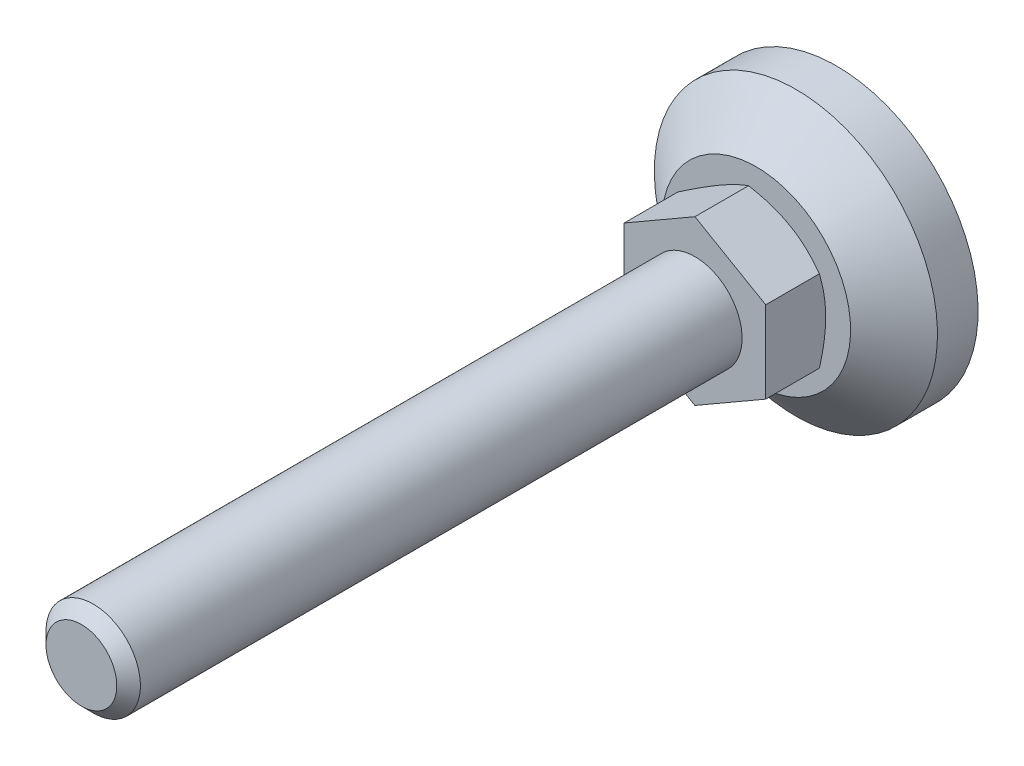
ISO-10303-21;
HEADER;
FILE_DESCRIPTION(('STEP AP214'),'2;1');
FILE_NAME('part.step','',(''),(''),'','','');
FILE_SCHEMA(('AUTOMOTIVE_DESIGN { 1 0 10303 214 1 1 1 1 }'));
ENDSEC;
DATA;
#1=APPLICATION_CONTEXT('core data for automotive mechanical design processes');
#2=APPLICATION_PROTOCOL_DEFINITION('international standard','automotive_design',2000,#1);
#3=PRODUCT_CONTEXT('',#1,'mechanical');
#4=PRODUCT('Part','Part','',(#3));
#5=PRODUCT_RELATED_PRODUCT_CATEGORY('part','',(#4));
#6=PRODUCT_DEFINITION_FORMATION('','',#4);
#7=PRODUCT_DEFINITION_CONTEXT('part definition',#1,'design');
#8=PRODUCT_DEFINITION('design','',#6,#7);
#9=PRODUCT_DEFINITION_SHAPE('','',#8);
#10=(LENGTH_UNIT() NAMED_UNIT(*) SI_UNIT(.MILLI.,.METRE.));
#11=(NAMED_UNIT(*) PLANE_ANGLE_UNIT() SI_UNIT($,.RADIAN.));
#12=(NAMED_UNIT(*) SI_UNIT($,.STERADIAN.) SOLID_ANGLE_UNIT());
#13=UNCERTAINTY_MEASURE_WITH_UNIT(LENGTH_MEASURE(1.E-05),#10,'distance_accuracy_value','');
#14=(GEOMETRIC_REPRESENTATION_CONTEXT(3) GLOBAL_UNCERTAINTY_ASSIGNED_CONTEXT((#13)) GLOBAL_UNIT_ASSIGNED_CONTEXT((#10,
#11,#12)) REPRESENTATION_CONTEXT('',''));
#15=CARTESIAN_POINT('',(0.,0.,0.));
#16=DIRECTION('',(0.,0.,1.));
#17=DIRECTION('',(1.,0.,0.));
#18=AXIS2_PLACEMENT_3D('',#15,#16,#17);
#19=CARTESIAN_POINT('',(0.,0.,30.));
#20=DIRECTION('',(0.,0.,1.));
#21=DIRECTION('',(0.5,-0.86602540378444,0.));
#22=AXIS2_PLACEMENT_3D('',#19,#20,#21);
#23=PLANE('',#22);
#24=DIRECTION('',(0.,1.,0.));
#25=VECTOR('',#24,1.);
#26=CARTESIAN_POINT('',(15.,-8.66025403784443,30.));
#27=LINE('',#26,#25);
#28=CARTESIAN_POINT('',(15.,-8.66025403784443,30.));
#29=VERTEX_POINT('',#28);
#30=CARTESIAN_POINT('',(15.,8.66025403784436,30.));
#31=VERTEX_POINT('',#30);
#32=EDGE_CURVE('E197',#29,#31,#27,.T.);
#33=ORIENTED_EDGE('',*,*,#32,.T.);
#34=DIRECTION('',(-0.866025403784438,0.5,0.));
#35=VECTOR('',#34,1.);
#36=CARTESIAN_POINT('',(15.,8.66025403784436,30.));
#37=LINE('',#36,#35);
#38=CARTESIAN_POINT('',(0.,17.3205080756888,30.));
#39=VERTEX_POINT('',#38);
#40=EDGE_CURVE('E320',#31,#39,#37,.T.);
#41=ORIENTED_EDGE('',*,*,#40,.T.);
#42=DIRECTION('',(-0.86602540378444,-0.5,0.));
#43=VECTOR('',#42,1.);
#44=CARTESIAN_POINT('',(0.,17.3205080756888,30.));
#45=LINE('',#44,#43);
#46=CARTESIAN_POINT('',(-15.,8.66025403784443,30.));
#47=VERTEX_POINT('',#46);
#48=EDGE_CURVE('E319',#39,#47,#45,.T.);
#49=ORIENTED_EDGE('',*,*,#48,.T.);
#50=DIRECTION('',(0.,-1.,0.));
#51=VECTOR('',#50,1.);
#52=CARTESIAN_POINT('',(-15.,8.66025403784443,30.));
#53=LINE('',#52,#51);
#54=CARTESIAN_POINT('',(-15.,-8.66025403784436,30.));
#55=VERTEX_POINT('',#54);
#56=EDGE_CURVE('E324',#47,#55,#53,.T.);
#57=ORIENTED_EDGE('',*,*,#56,.T.);
#58=DIRECTION('',(0.866025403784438,-0.5,0.));
#59=VECTOR('',#58,1.);
#60=CARTESIAN_POINT('',(-15.,-8.66025403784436,30.));
#61=LINE('',#60,#59);
#62=CARTESIAN_POINT('',(0.,-17.3205080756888,30.));
#63=VERTEX_POINT('',#62);
#64=EDGE_CURVE('E326',#55,#63,#61,.T.);
#65=ORIENTED_EDGE('',*,*,#64,.T.);
#66=DIRECTION('',(0.86602540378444,0.5,0.));
#67=VECTOR('',#66,1.);
#68=CARTESIAN_POINT('',(0.,-17.3205080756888,30.));
#69=LINE('',#68,#67);
#70=EDGE_CURVE('E37',#63,#29,#69,.T.);
#71=ORIENTED_EDGE('',*,*,#70,.T.);
#72=EDGE_LOOP('',(#33,#41,#49,#57,#65,#71));
#73=FACE_BOUND('',#72,.T.);
#74=CARTESIAN_POINT('',(0.,0.,30.));
#75=DIRECTION('',(0.,0.,1.));
#76=DIRECTION('',(0.5,-0.86602540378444,0.));
#77=AXIS2_PLACEMENT_3D('',#74,#75,#76);
#78=CIRCLE('',#77,10.);
#79=CARTESIAN_POINT('',(5.,-8.6602540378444,30.));
#80=VERTEX_POINT('',#79);
#81=EDGE_CURVE('E201',#80,#80,#78,.T.);
#82=ORIENTED_EDGE('',*,*,#81,.F.);
#83=EDGE_LOOP('',(#82));
#84=FACE_BOUND('',#83,.T.);
#85=ADVANCED_FACE('F14',(#73,#84),#23,.T.);
#86=CARTESIAN_POINT('',(-9.9946349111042,17.3112154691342,17.));
#87=DIRECTION('',(0.,0.,1.));
#88=DIRECTION('',(0.5,-0.86602540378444,0.));
#89=AXIS2_PLACEMENT_3D('',#86,#87,#88);
#90=PLANE('',#89);
#91=CARTESIAN_POINT('',(0.,0.,17.));
#92=DIRECTION('',(0.,0.,-1.));
#93=DIRECTION('',(-0.5,0.86602540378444,0.));
#94=AXIS2_PLACEMENT_3D('',#91,#92,#93);
#95=CIRCLE('',#94,19.9892698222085);
#96=CARTESIAN_POINT('',(-9.99463491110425,17.3112154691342,17.));
#97=VERTEX_POINT('',#96);
#98=EDGE_CURVE('E102',#97,#97,#95,.T.);
#99=ORIENTED_EDGE('',*,*,#98,.F.);
#100=EDGE_LOOP('',(#99));
#101=FACE_BOUND('',#100,.T.);
#102=CARTESIAN_POINT('',(0.,0.,17.));
#103=DIRECTION('',(0.,0.,-1.));
#104=DIRECTION('',(-0.5,0.86602540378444,0.));
#105=AXIS2_PLACEMENT_3D('',#102,#103,#104);
#106=CIRCLE('',#105,14.5);
#107=CARTESIAN_POINT('',(-7.25,12.5573683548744,17.));
#108=VERTEX_POINT('',#107);
#109=EDGE_CURVE('E84',#108,#108,#106,.T.);
#110=ORIENTED_EDGE('',*,*,#109,.T.);
#111=EDGE_LOOP('',(#110));
#112=FACE_BOUND('',#111,.T.);
#113=ADVANCED_FACE('F174',(#101,#112),#90,.T.);
#114=CARTESIAN_POINT('',(0.,0.,0.));
#115=DIRECTION('',(0.,0.,-1.));
#116=DIRECTION('',(-0.5,0.86602540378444,0.));
#117=AXIS2_PLACEMENT_3D('',#114,#115,#116);
#118=PLANE('',#117);
#119=CARTESIAN_POINT('',(0.,0.,0.));
#120=DIRECTION('',(0.,0.,-1.));
#121=DIRECTION('',(-0.5,0.86602540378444,0.));
#122=AXIS2_PLACEMENT_3D('',#119,#120,#121);
#123=CIRCLE('',#122,30.);
#124=CARTESIAN_POINT('',(-15.,25.9807621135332,0.));
#125=VERTEX_POINT('',#124);
#126=EDGE_CURVE('E73',#125,#125,#123,.T.);
#127=ORIENTED_EDGE('',*,*,#126,.T.);
#128=EDGE_LOOP('',(#127));
#129=FACE_BOUND('',#128,.T.);
#130=ADVANCED_FACE('F177',(#129),#118,.T.);
#131=CARTESIAN_POINT('',(0.,0.,-75.4972525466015));
#132=DIRECTION('',(0.,0.,-1.));
#133=DIRECTION('',(-0.5,0.86602540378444,0.));
#134=AXIS2_PLACEMENT_3D('',#131,#132,#133);
#135=CYLINDRICAL_SURFACE('',#134,30.);
#136=CARTESIAN_POINT('',(0.,0.,8.6));
#137=DIRECTION('',(0.,0.,-1.));
#138=DIRECTION('',(-0.5,0.86602540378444,0.));
#139=AXIS2_PLACEMENT_3D('',#136,#137,#138);
#140=CIRCLE('',#139,30.);
#141=CARTESIAN_POINT('',(-15.,25.9807621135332,8.6));
#142=VERTEX_POINT('',#141);
#143=EDGE_CURVE('E105',#142,#142,#140,.T.);
#144=ORIENTED_EDGE('',*,*,#143,.T.);
#145=EDGE_LOOP('',(#144));
#146=FACE_BOUND('',#145,.T.);
#147=ORIENTED_EDGE('',*,*,#126,.F.);
#148=EDGE_LOOP('',(#147));
#149=FACE_BOUND('',#148,.T.);
#150=ADVANCED_FACE('F181',(#146,#149),#135,.T.);
#151=CARTESIAN_POINT('',(0.,0.,8.6));
#152=DIRECTION('',(0.,0.,-1.));
#153=DIRECTION('',(-0.5,0.86602540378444,0.));
#154=AXIS2_PLACEMENT_3D('',#151,#152,#153);
#155=CONICAL_SURFACE('',#154,30.,0.872664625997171);
#156=ORIENTED_EDGE('',*,*,#98,.T.);
#157=EDGE_LOOP('',(#156));
#158=FACE_BOUND('',#157,.T.);
#159=ORIENTED_EDGE('',*,*,#143,.F.);
#160=EDGE_LOOP('',(#159));
#161=FACE_BOUND('',#160,.T.);
#162=ADVANCED_FACE('F121',(#158,#161),#155,.T.);
#163=CARTESIAN_POINT('',(0.,0.,22.6717337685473));
#164=DIRECTION('',(0.,0.,1.));
#165=DIRECTION('',(0.5,-0.86602540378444,0.));
#166=AXIS2_PLACEMENT_3D('',#163,#164,#165);
#167=CONICAL_SURFACE('',#166,24.3237310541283,1.0471975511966);
#168=ORIENTED_EDGE('',*,*,#109,.F.);
#169=EDGE_LOOP('',(#168));
#170=FACE_BOUND('',#169,.T.);
#171=CARTESIAN_POINT('',(-12.8456594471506,-24.7369530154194,24.7211504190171));
#172=CARTESIAN_POINT('',(-12.5611280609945,-24.5726787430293,24.5612751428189));
#173=CARTESIAN_POINT('',(-12.2762681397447,-24.4082147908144,24.4021798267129));
#174=CARTESIAN_POINT('',(-11.7058227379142,-24.0788679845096,24.0857253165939));
#175=CARTESIAN_POINT('',(-11.4202372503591,-23.913985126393,23.9283661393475));
#176=CARTESIAN_POINT('',(-10.5622163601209,-23.4186065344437,23.4591171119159));
#177=CARTESIAN_POINT('',(-9.98859766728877,-23.0874276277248,23.1501014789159));
#178=CARTESIAN_POINT('',(-8.83456075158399,-22.4211441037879,22.5399454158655));
#179=CARTESIAN_POINT('',(-8.25412262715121,-22.0860279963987,22.2388550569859));
#180=CARTESIAN_POINT('',(-7.08869976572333,-21.4131707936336,21.6486868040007));
#181=CARTESIAN_POINT('',(-6.50371523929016,-21.0754298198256,21.3596083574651));
#182=CARTESIAN_POINT('',(-5.30863673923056,-20.3854509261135,20.7872320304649));
#183=CARTESIAN_POINT('',(-4.69835665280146,-20.0331055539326,20.5044496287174));
#184=CARTESIAN_POINT('',(-3.47072651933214,-19.3243329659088,19.9597325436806));
#185=CARTESIAN_POINT('',(-2.85337569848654,-18.9679053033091,19.6978001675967));
#186=CARTESIAN_POINT('',(-1.61173392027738,-18.251043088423,19.2014950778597));
#187=CARTESIAN_POINT('',(-0.987459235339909,-17.8906179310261,18.9670685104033));
#188=CARTESIAN_POINT('',(0.270101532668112,-17.1645648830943,18.533130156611));
#189=CARTESIAN_POINT('',(0.903384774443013,-16.7989386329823,18.3336076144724));
#190=CARTESIAN_POINT('',(1.85843143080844,-16.2475421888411,18.0681549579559));
#191=CARTESIAN_POINT('',(2.17672728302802,-16.0637739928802,17.9854955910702));
#192=CARTESIAN_POINT('',(2.8155301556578,-15.6949609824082,17.8324159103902));
#193=CARTESIAN_POINT('',(3.13603713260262,-15.509916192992,17.761995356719));
#194=CARTESIAN_POINT('',(3.77905622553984,-15.1386689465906,17.6346216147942));
#195=CARTESIAN_POINT('',(4.1015683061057,-14.952466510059,17.5776681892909));
#196=CARTESIAN_POINT('',(4.7482706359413,-14.5790927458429,17.4783560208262));
#197=CARTESIAN_POINT('',(5.07246081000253,-14.39192146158,17.4359966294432));
#198=CARTESIAN_POINT('',(5.7177482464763,-14.0193645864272,17.3672579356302));
#199=CARTESIAN_POINT('',(6.03882895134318,-13.8339885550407,17.3406726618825));
#200=CARTESIAN_POINT('',(6.68167638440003,-13.4628404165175,17.3032157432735));
#201=CARTESIAN_POINT('',(7.0034431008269,-13.2770683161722,17.2923438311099));
#202=CARTESIAN_POINT('',(7.64708696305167,-12.9054603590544,17.2865732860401));
#203=CARTESIAN_POINT('',(7.96896410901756,-12.719624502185,17.291674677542));
#204=CARTESIAN_POINT('',(8.6122410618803,-12.3482283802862,17.31772364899));
#205=CARTESIAN_POINT('',(8.93364084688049,-12.1626681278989,17.3386719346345));
#206=CARTESIAN_POINT('',(9.70006843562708,-11.7201709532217,17.4070708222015));
#207=CARTESIAN_POINT('',(10.1446275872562,-11.4635046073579,17.4616548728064));
#208=CARTESIAN_POINT('',(11.0305797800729,-10.9519998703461,17.598223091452));
#209=CARTESIAN_POINT('',(11.4719724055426,-10.6971617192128,17.6802107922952));
#210=CARTESIAN_POINT('',(12.3511241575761,-10.1895832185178,17.8686701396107));
#211=CARTESIAN_POINT('',(12.7888803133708,-9.93684458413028,17.9751600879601));
#212=CARTESIAN_POINT('',(13.6600677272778,-9.43386429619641,18.2093621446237));
#213=CARTESIAN_POINT('',(14.093499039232,-9.18362261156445,18.3370739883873));
#214=CARTESIAN_POINT('',(14.9657613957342,-8.68002170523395,18.6136784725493));
#215=CARTESIAN_POINT('',(15.4044935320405,-8.42671958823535,18.7629840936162));
#216=CARTESIAN_POINT('',(16.2776387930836,-7.92260893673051,19.0774927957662));
#217=CARTESIAN_POINT('',(16.7120518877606,-7.67180041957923,19.2426959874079));
#218=CARTESIAN_POINT('',(17.5767675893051,-7.17255657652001,19.5863356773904));
#219=CARTESIAN_POINT('',(18.0070714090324,-6.92412055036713,19.7647681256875));
#220=CARTESIAN_POINT('',(18.8640855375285,-6.42932321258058,20.1327209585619));
#221=CARTESIAN_POINT('',(19.2907959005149,-6.18296186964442,20.3222411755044));
#222=CARTESIAN_POINT('',(20.3428317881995,-5.57556866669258,20.8026992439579));
#223=CARTESIAN_POINT('',(20.9662920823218,-5.21561369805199,21.0990762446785));
#224=CARTESIAN_POINT('',(22.2075096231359,-4.49899641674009,21.7073961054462));
#225=CARTESIAN_POINT('',(22.8252664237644,-4.14233436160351,22.0193401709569));
#226=CARTESIAN_POINT('',(24.0562171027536,-3.43164465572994,22.6554928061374));
#227=CARTESIAN_POINT('',(24.6694096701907,-3.07761776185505,22.9797047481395));
#228=CARTESIAN_POINT('',(25.8918722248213,-2.37182867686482,23.6377669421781));
#229=CARTESIAN_POINT('',(26.5011423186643,-2.02006642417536,23.9716169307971));
#230=CARTESIAN_POINT('',(27.717227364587,-1.31795939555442,24.6474851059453));
#231=CARTESIAN_POINT('',(28.3240381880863,-0.967617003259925,24.9895131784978));
#232=CARTESIAN_POINT('',(29.5349682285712,-0.268486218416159,25.6798644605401));
#233=CARTESIAN_POINT('',(30.1390874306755,0.0803021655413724,26.0281877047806));
#234=CARTESIAN_POINT('',(31.3449758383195,0.776522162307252,26.7299417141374));
#235=CARTESIAN_POINT('',(31.9467453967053,1.12395397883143,27.0833716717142));
#236=CARTESIAN_POINT('',(33.1483798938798,1.81771797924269,27.7945141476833));
#237=CARTESIAN_POINT('',(33.7482448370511,2.16405016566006,28.1522266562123));
#238=CARTESIAN_POINT('',(35.4362393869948,3.13861427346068,29.1651922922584));
#239=CARTESIAN_POINT('',(36.5225182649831,3.76577767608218,29.8245570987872));
#240=CARTESIAN_POINT('',(38.6911220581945,5.01782165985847,31.1520110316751));
#241=CARTESIAN_POINT('',(39.7734467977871,5.64270213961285,31.8201005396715));
#242=CARTESIAN_POINT('',(41.9319563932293,6.88891823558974,33.1609996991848));
#243=CARTESIAN_POINT('',(43.0081499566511,7.51025887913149,33.8337906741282));
#244=CARTESIAN_POINT('',(44.620597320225,8.441205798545,34.8467910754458));
#245=CARTESIAN_POINT('',(45.1577559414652,8.75133447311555,35.1850829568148));
#246=CARTESIAN_POINT('',(46.2315316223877,9.37127915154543,35.8628086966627));
#247=CARTESIAN_POINT('',(46.7681486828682,9.68109515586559,36.2022425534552));
#248=CARTESIAN_POINT('',(47.3045265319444,9.99077305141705,36.5421798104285));
#249=B_SPLINE_CURVE_WITH_KNOTS('',3,(#171,#172,#173,#174,#175,#176,#177,#178,#179,#180,#181,
#182,#183,#184,#185,#186,#187,#188,#189,#190,#191,#192,#193,#194,#195,#196,#197,#198,#199,#200,
#201,#202,#203,#204,#205,#206,#207,#208,#209,#210,#211,#212,#213,#214,#215,#216,#217,#218,#219,
#220,#221,#222,#223,#224,#225,#226,#227,#228,#229,#230,#231,#232,#233,#234,#235,#236,#237,#238,
#239,#240,#241,#242,#243,#244,#245,#246,#247,#248),.UNSPECIFIED.,.F.,.F.,(4,2,2,2,2,2,2,2,2,2,2,
2,2,2,2,2,2,2,2,2,2,2,2,2,2,2,2,2,2,2,2,2,2,2,2,2,2,2,4),(0.,1.09614509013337,2.19230075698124,
4.38492481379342,6.5891013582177,8.79317641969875,11.0708608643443,13.3487970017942,
15.622195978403,17.894893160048,19.0248728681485,20.1548304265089,21.2847680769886,
22.4146555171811,23.5294447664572,24.6442150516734,25.7589870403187,26.8738086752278,
28.4216372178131,29.9696653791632,31.5188536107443,33.0680225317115,34.6521549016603,
36.236298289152,37.8199586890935,39.4035951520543,41.7389293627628,44.0744446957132,
46.4106067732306,48.7467050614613,51.0857864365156,53.4248807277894,55.7636090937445,
58.1023320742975,62.3535003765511,66.6048552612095,70.8441948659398,72.9637328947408,
75.083267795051),.UNSPECIFIED.);
#250=CARTESIAN_POINT('',(0.,-17.3205080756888,18.6284210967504));
#251=VERTEX_POINT('',#250);
#252=CARTESIAN_POINT('',(15.,-8.66025403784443,18.6284210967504));
#253=VERTEX_POINT('',#252);
#254=EDGE_CURVE('E65',#251,#253,#249,.T.);
#255=ORIENTED_EDGE('',*,*,#254,.F.);
#256=CARTESIAN_POINT('',(-15.0002,-8.66013856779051,18.6284877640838));
#257=CARTESIAN_POINT('',(-14.6705058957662,-8.85048754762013,18.5185969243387));
#258=CARTESIAN_POINT('',(-14.3395258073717,-9.0415789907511,18.4136927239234));
#259=CARTESIAN_POINT('',(-13.674911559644,-9.42529420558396,18.2152437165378));
#260=CARTESIAN_POINT('',(-13.3412765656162,-9.61791845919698,18.1217026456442));
#261=CARTESIAN_POINT('',(-12.6707077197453,-10.0050715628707,17.9472372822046));
#262=CARTESIAN_POINT('',(-12.333767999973,-10.1996038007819,17.8663428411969));
#263=CARTESIAN_POINT('',(-11.6575472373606,-10.5900200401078,17.7189077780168));
#264=CARTESIAN_POINT('',(-11.3182663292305,-10.7859039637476,17.6523663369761));
#265=CARTESIAN_POINT('',(-10.6460568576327,-11.1740042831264,17.5364675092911));
#266=CARTESIAN_POINT('',(-10.3131781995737,-11.3661918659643,17.4867265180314));
#267=CARTESIAN_POINT('',(-9.64589556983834,-11.7514476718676,17.4033218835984));
#268=CARTESIAN_POINT('',(-9.31149156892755,-11.9445159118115,17.3696585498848));
#269=CARTESIAN_POINT('',(-8.64212181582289,-12.3309767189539,17.3192592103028));
#270=CARTESIAN_POINT('',(-8.30715720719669,-12.5243686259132,17.3025030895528));
#271=CARTESIAN_POINT('',(-7.63691878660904,-12.9113309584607,17.2862785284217));
#272=CARTESIAN_POINT('',(-7.30164498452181,-13.104901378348,17.2868095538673));
#273=CARTESIAN_POINT('',(-6.67485311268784,-13.4667798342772,17.303951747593));
#274=CARTESIAN_POINT('',(-6.38329037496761,-13.6351136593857,17.3184719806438));
#275=CARTESIAN_POINT('',(-5.80083556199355,-13.971394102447,17.3603122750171));
#276=CARTESIAN_POINT('',(-5.50994353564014,-14.1393406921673,17.3876332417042));
#277=CARTESIAN_POINT('',(-4.9289881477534,-14.4747554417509,17.4545986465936));
#278=CARTESIAN_POINT('',(-4.63892567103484,-14.6422230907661,17.4942532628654));
#279=CARTESIAN_POINT('',(-4.06016058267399,-14.9763732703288,17.5851902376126));
#280=CARTESIAN_POINT('',(-3.77145806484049,-15.1430557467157,17.636473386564));
#281=CARTESIAN_POINT('',(-2.89508556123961,-15.6490296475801,17.8090619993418));
#282=CARTESIAN_POINT('',(-2.30995340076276,-15.9868558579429,17.9475763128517));
#283=CARTESIAN_POINT('',(-1.14841408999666,-16.657470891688,18.26194710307));
#284=CARTESIAN_POINT('',(-0.571992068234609,-16.9902683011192,18.4377297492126));
#285=CARTESIAN_POINT('',(0.000199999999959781,-17.3206235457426,18.6284877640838));
#286=B_SPLINE_CURVE_WITH_KNOTS('',3,(#256,#257,#258,#259,#260,#261,#262,#263,#264,#265,#266,
#267,#268,#269,#270,#271,#272,#273,#274,#275,#276,#277,#278,#279,#280,#281,#282,#283,#284,#285),
.UNSPECIFIED.,.F.,.F.,(4,2,2,2,2,2,2,2,2,2,2,2,2,2,4),(0.,1.18875411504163,2.37789802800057,
3.56980778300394,4.76164951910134,5.92407379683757,7.08652044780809,8.24758247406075,
9.40860862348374,10.4193068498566,11.4300765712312,12.4416826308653,13.4533574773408,
15.5211962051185,17.5849760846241),.UNSPECIFIED.);
#287=CARTESIAN_POINT('',(-15.,-8.66025403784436,18.6284210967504));
#288=VERTEX_POINT('',#287);
#289=EDGE_CURVE('E68',#288,#251,#286,.T.);
#290=ORIENTED_EDGE('',*,*,#289,.F.);
#291=CARTESIAN_POINT('',(-15.,8.66048497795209,18.6284877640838));
#292=CARTESIAN_POINT('',(-15.,8.27978701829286,18.5185969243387));
#293=CARTESIAN_POINT('',(-15.,7.89760413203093,18.4136927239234));
#294=CARTESIAN_POINT('',(-15.,7.13017370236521,18.2152437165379));
#295=CARTESIAN_POINT('',(-15.,6.74492519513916,18.1217026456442));
#296=CARTESIAN_POINT('',(-15.,5.97061898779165,17.9472372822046));
#297=CARTESIAN_POINT('',(-15.,5.58155451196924,17.8663428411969));
#298=CARTESIAN_POINT('',(-15.,4.80072203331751,17.7189077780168));
#299=CARTESIAN_POINT('',(-15.,4.40895418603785,17.6523663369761));
#300=CARTESIAN_POINT('',(-15.,3.63275354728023,17.5364675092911));
#301=CARTESIAN_POINT('',(-15.,3.24837838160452,17.4867265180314));
#302=CARTESIAN_POINT('',(-15.,2.47786676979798,17.4033218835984));
#303=CARTESIAN_POINT('',(-15.,2.0917302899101,17.3696585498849));
#304=CARTESIAN_POINT('',(-15.,1.31880867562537,17.3192592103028));
#305=CARTESIAN_POINT('',(-15.,0.932024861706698,17.3025030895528));
#306=CARTESIAN_POINT('',(-15.,0.158100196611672,17.2862785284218));
#307=CARTESIAN_POINT('',(-15.,-0.229040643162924,17.2868095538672));
#308=CARTESIAN_POINT('',(-15.,-0.952797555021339,17.303951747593));
#309=CARTESIAN_POINT('',(-15.,-1.28946520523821,17.3184719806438));
#310=CARTESIAN_POINT('',(-15.,-1.96202609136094,17.3603122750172));
#311=CARTESIAN_POINT('',(-15.,-2.29791927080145,17.3876332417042));
#312=CARTESIAN_POINT('',(-15.,-2.96874876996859,17.4545986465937));
#313=CARTESIAN_POINT('',(-15.,-3.30368406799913,17.4942532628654));
#314=CARTESIAN_POINT('',(-15.,-3.97198442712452,17.5851902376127));
#315=CARTESIAN_POINT('',(-15.,-4.3053493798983,17.636473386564));
#316=CARTESIAN_POINT('',(-15.,-5.317297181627,17.8090619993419));
#317=CARTESIAN_POINT('',(-15.,-5.99294960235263,17.9475763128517));
#318=CARTESIAN_POINT('',(-15.,-7.33417966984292,18.26194710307));
#319=CARTESIAN_POINT('',(-15.,-7.99977448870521,18.4377297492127));
#320=CARTESIAN_POINT('',(-15.,-8.66048497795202,18.6284877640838));
#321=B_SPLINE_CURVE_WITH_KNOTS('',3,(#291,#292,#293,#294,#295,#296,#297,#298,#299,#300,#301,
#302,#303,#304,#305,#306,#307,#308,#309,#310,#311,#312,#313,#314,#315,#316,#317,#318,#319,#320),
.UNSPECIFIED.,.F.,.F.,(4,2,2,2,2,2,2,2,2,2,2,2,2,2,4),(0.,1.18875411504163,2.37789802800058,
3.56980778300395,4.76164951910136,5.92407379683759,7.08652044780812,8.24758247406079,
9.40860862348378,10.4193068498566,11.4300765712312,12.4416826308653,13.4533574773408,
15.5211962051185,17.5849760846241),.UNSPECIFIED.);
#322=CARTESIAN_POINT('',(-15.,8.66025403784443,18.6284210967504));
#323=VERTEX_POINT('',#322);
#324=EDGE_CURVE('E83',#323,#288,#321,.T.);
#325=ORIENTED_EDGE('',*,*,#324,.F.);
#326=CARTESIAN_POINT('',(-27.8456594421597,1.24380910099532,24.7211504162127));
#327=CARTESIAN_POINT('',(-27.5611280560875,1.40808337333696,24.561275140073));
#328=CARTESIAN_POINT('',(-27.2762681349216,1.5725473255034,24.4021798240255));
#329=CARTESIAN_POINT('',(-26.7058227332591,1.90189413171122,24.0857253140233));
#330=CARTESIAN_POINT('',(-26.4202372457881,2.06677698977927,23.9283661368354));
#331=CARTESIAN_POINT('',(-25.5622163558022,2.56215558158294,23.4591171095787));
#332=CARTESIAN_POINT('',(-24.9885976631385,2.89333448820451,23.150101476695));
#333=CARTESIAN_POINT('',(-23.8345607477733,3.55961801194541,22.5399454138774));
#334=CARTESIAN_POINT('',(-23.2541226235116,3.89473411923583,22.2388550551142));
#335=CARTESIAN_POINT('',(-22.088699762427,4.56759132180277,21.64868680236));
#336=CARTESIAN_POINT('',(-21.503715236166,4.9053322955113,21.3596083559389));
#337=CARTESIAN_POINT('',(-20.3086367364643,5.59531118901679,20.787232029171));
#338=CARTESIAN_POINT('',(-19.698356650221,5.94765656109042,20.5044496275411));
#339=CARTESIAN_POINT('',(-18.4707265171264,6.65642914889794,19.9597325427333));
#340=CARTESIAN_POINT('',(-17.8533756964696,7.01285681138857,19.6978001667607));
#341=CARTESIAN_POINT('',(-16.6117339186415,7.72971902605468,19.2014950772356));
#342=CARTESIAN_POINT('',(-15.9874592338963,8.09014418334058,18.96706850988));
#343=CARTESIAN_POINT('',(-14.7298984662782,8.81619723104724,18.5331301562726));
#344=CARTESIAN_POINT('',(-14.0966152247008,9.1818234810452,18.3336076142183));
#345=CARTESIAN_POINT('',(-13.1415685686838,9.73321992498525,18.0681549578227));
#346=CARTESIAN_POINT('',(-12.8232727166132,9.91698812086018,17.9854955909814));
#347=CARTESIAN_POINT('',(-12.1844698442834,10.2858011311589,17.8324159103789));
#348=CARTESIAN_POINT('',(-11.8639628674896,10.4708459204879,17.7619953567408));
#349=CARTESIAN_POINT('',(-11.2209437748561,10.8420931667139,17.6346216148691));
#350=CARTESIAN_POINT('',(-10.898431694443,11.0282956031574,17.5776681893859));
#351=CARTESIAN_POINT('',(-10.2517293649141,11.4016693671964,17.4783560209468));
#352=CARTESIAN_POINT('',(-9.92753919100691,11.5888406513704,17.4359966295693));
#353=CARTESIAN_POINT('',(-9.28225175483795,11.9613975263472,17.3672579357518));
#354=CARTESIAN_POINT('',(-8.96117105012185,12.1467735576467,17.3406726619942));
#355=CARTESIAN_POINT('',(-8.31832361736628,12.5179216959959,17.30321574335));
#356=CARTESIAN_POINT('',(-7.9965569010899,12.7036937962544,17.2923438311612));
#357=CARTESIAN_POINT('',(-7.352913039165,13.075301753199,17.2865732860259));
#358=CARTESIAN_POINT('',(-7.03103589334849,13.2611376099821,17.2916746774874));
#359=CARTESIAN_POINT('',(-6.38775894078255,13.6325337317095,17.3177236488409));
#360=CARTESIAN_POINT('',(-6.06635915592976,13.8180939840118,17.3386719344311));
#361=CARTESIAN_POINT('',(-5.29993156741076,14.2605911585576,17.4070708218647));
#362=CARTESIAN_POINT('',(-4.85537241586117,14.5172575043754,17.4616548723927));
#363=CARTESIAN_POINT('',(-3.96942022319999,15.0287622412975,17.5982230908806));
#364=CARTESIAN_POINT('',(-3.52802759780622,15.2836003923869,17.6802107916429));
#365=CARTESIAN_POINT('',(-2.64887584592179,15.7911788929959,17.8686701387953));
#366=CARTESIAN_POINT('',(-2.21111969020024,16.0439175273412,17.9751600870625));
#367=CARTESIAN_POINT('',(-1.33993227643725,16.5468978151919,18.2093621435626));
#368=CARTESIAN_POINT('',(-0.906500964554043,16.7971394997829,18.3370739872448));
#369=CARTESIAN_POINT('',(-0.0342386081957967,17.3007404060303,18.6136784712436));
#370=CARTESIAN_POINT('',(0.404493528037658,17.5540425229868,18.7629840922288));
#371=CARTESIAN_POINT('',(1.27763878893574,18.0581531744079,19.0774927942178));
#372=CARTESIAN_POINT('',(1.71205188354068,18.3089616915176,19.2426959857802));
#373=CARTESIAN_POINT('',(2.57676758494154,18.8082055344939,19.586335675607));
#374=CARTESIAN_POINT('',(3.00707140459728,19.0566415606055,19.7647681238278));
#375=CARTESIAN_POINT('',(3.86408553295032,19.5514388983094,20.1327209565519));
#376=CARTESIAN_POINT('',(4.29079589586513,19.7978002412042,20.3222411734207));
#377=CARTESIAN_POINT('',(5.34283178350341,20.4051934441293,20.8026992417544));
#378=CARTESIAN_POINT('',(5.9662920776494,20.7651484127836,21.0990762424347));
#379=CARTESIAN_POINT('',(7.20750961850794,21.4817656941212,21.707396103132));
#380=CARTESIAN_POINT('',(7.82526641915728,21.8384277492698,22.0193401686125));
#381=CARTESIAN_POINT('',(9.05621709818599,22.5491174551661,22.6554928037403));
#382=CARTESIAN_POINT('',(9.66940966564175,22.9031443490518,22.97970474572));
#383=CARTESIAN_POINT('',(10.8918722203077,23.6089334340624,23.6377669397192));
#384=CARTESIAN_POINT('',(11.5011423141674,23.9606956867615,23.9716169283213));
#385=CARTESIAN_POINT('',(12.7172273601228,24.6628027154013,24.6474851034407));
#386=CARTESIAN_POINT('',(13.3240381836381,25.0131451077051,24.9895131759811));
#387=CARTESIAN_POINT('',(14.5349682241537,25.7122758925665,25.6798644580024));
#388=CARTESIAN_POINT('',(15.1390874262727,26.0610642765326,26.0281877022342));
#389=CARTESIAN_POINT('',(16.3449758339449,26.7572842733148,26.7299417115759));
#390=CARTESIAN_POINT('',(16.9467453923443,27.1047160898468,27.0833716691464));
#391=CARTESIAN_POINT('',(18.1483798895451,27.7984800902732,27.7945141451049));
#392=CARTESIAN_POINT('',(18.7482448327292,28.144812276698,28.1522266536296));
#393=CARTESIAN_POINT('',(20.4362393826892,29.119376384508,29.1651922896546));
#394=CARTESIAN_POINT('',(21.5225182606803,29.7465397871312,29.8245570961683));
#395=CARTESIAN_POINT('',(23.6911220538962,30.99858377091,31.1520110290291));
#396=CARTESIAN_POINT('',(24.7734467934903,31.6234642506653,31.8201005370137));
#397=CARTESIAN_POINT('',(26.9319563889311,32.8696803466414,33.1609996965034));
#398=CARTESIAN_POINT('',(28.0081499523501,33.4910209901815,33.833790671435));
#399=CARTESIAN_POINT('',(29.6205973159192,34.4219679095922,34.8467910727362));
#400=CARTESIAN_POINT('',(30.1577559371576,34.7320965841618,35.1850829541));
#401=CARTESIAN_POINT('',(31.2315316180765,35.3520412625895,35.8628086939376));
#402=CARTESIAN_POINT('',(31.7681486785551,35.6618572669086,36.2022425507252));
#403=CARTESIAN_POINT('',(32.3045265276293,35.9715351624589,36.5421798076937));
#404=B_SPLINE_CURVE_WITH_KNOTS('',3,(#326,#327,#328,#329,#330,#331,#332,#333,#334,#335,#336,
#337,#338,#339,#340,#341,#342,#343,#344,#345,#346,#347,#348,#349,#350,#351,#352,#353,#354,#355,
#356,#357,#358,#359,#360,#361,#362,#363,#364,#365,#366,#367,#368,#369,#370,#371,#372,#373,#374,
#375,#376,#377,#378,#379,#380,#381,#382,#383,#384,#385,#386,#387,#388,#389,#390,#391,#392,#393,
#394,#395,#396,#397,#398,#399,#400,#401,#402,#403),.UNSPECIFIED.,.F.,.F.,(4,2,2,2,2,2,2,2,2,2,2,
2,2,2,2,2,2,2,2,2,2,2,2,2,2,2,2,2,2,2,2,2,2,2,2,2,2,2,4),(0.,1.09614508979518,2.19230075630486,
4.38492481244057,6.5891013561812,8.79317641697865,11.0708608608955,13.3487969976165,
15.6221959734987,17.8948931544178,19.024872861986,20.1548304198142,21.2847680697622,
22.4146555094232,23.5294447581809,24.6442150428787,25.7589870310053,26.8738086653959,
28.421637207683,29.9696653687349,31.5188536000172,33.0680225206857,34.6521548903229,
36.2362982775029,37.8199586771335,39.4035951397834,41.7389293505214,44.0744446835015,
46.4106067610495,48.7467050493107,51.0857864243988,53.4248807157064,55.7636090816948,
58.1023320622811,62.3535003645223,66.6048552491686,70.8441948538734,72.9637328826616,
75.0832677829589),.UNSPECIFIED.);
#405=CARTESIAN_POINT('',(0.,17.3205080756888,18.6284210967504));
#406=VERTEX_POINT('',#405);
#407=EDGE_CURVE('E143',#406,#323,#404,.F.);
#408=ORIENTED_EDGE('',*,*,#407,.F.);
#409=CARTESIAN_POINT('',(15.0002,8.66013856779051,18.6284877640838));
#410=CARTESIAN_POINT('',(14.6705058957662,8.85048754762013,18.5185969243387));
#411=CARTESIAN_POINT('',(14.3395258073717,9.0415789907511,18.4136927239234));
#412=CARTESIAN_POINT('',(13.674911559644,9.42529420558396,18.2152437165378));
#413=CARTESIAN_POINT('',(13.3412765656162,9.61791845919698,18.1217026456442));
#414=CARTESIAN_POINT('',(12.6707077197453,10.0050715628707,17.9472372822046));
#415=CARTESIAN_POINT('',(12.333767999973,10.1996038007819,17.8663428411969));
#416=CARTESIAN_POINT('',(11.6575472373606,10.5900200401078,17.7189077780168));
#417=CARTESIAN_POINT('',(11.3182663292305,10.7859039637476,17.6523663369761));
#418=CARTESIAN_POINT('',(10.6460568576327,11.1740042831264,17.5364675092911));
#419=CARTESIAN_POINT('',(10.3131781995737,11.3661918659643,17.4867265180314));
#420=CARTESIAN_POINT('',(9.64589556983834,11.7514476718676,17.4033218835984));
#421=CARTESIAN_POINT('',(9.31149156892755,11.9445159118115,17.3696585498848));
#422=CARTESIAN_POINT('',(8.64212181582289,12.3309767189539,17.3192592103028));
#423=CARTESIAN_POINT('',(8.30715720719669,12.5243686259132,17.3025030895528));
#424=CARTESIAN_POINT('',(7.63691878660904,12.9113309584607,17.2862785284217));
#425=CARTESIAN_POINT('',(7.30164498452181,13.104901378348,17.2868095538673));
#426=CARTESIAN_POINT('',(6.67485311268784,13.4667798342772,17.303951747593));
#427=CARTESIAN_POINT('',(6.38329037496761,13.6351136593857,17.3184719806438));
#428=CARTESIAN_POINT('',(5.80083556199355,13.971394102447,17.3603122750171));
#429=CARTESIAN_POINT('',(5.50994353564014,14.1393406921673,17.3876332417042));
#430=CARTESIAN_POINT('',(4.9289881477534,14.4747554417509,17.4545986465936));
#431=CARTESIAN_POINT('',(4.63892567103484,14.6422230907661,17.4942532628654));
#432=CARTESIAN_POINT('',(4.06016058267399,14.9763732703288,17.5851902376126));
#433=CARTESIAN_POINT('',(3.77145806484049,15.1430557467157,17.636473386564));
#434=CARTESIAN_POINT('',(2.89508556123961,15.6490296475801,17.8090619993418));
#435=CARTESIAN_POINT('',(2.30995340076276,15.9868558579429,17.9475763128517));
#436=CARTESIAN_POINT('',(1.14841408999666,16.657470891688,18.26194710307));
#437=CARTESIAN_POINT('',(0.571992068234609,16.9902683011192,18.4377297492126));
#438=CARTESIAN_POINT('',(-0.000199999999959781,17.3206235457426,18.6284877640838));
#439=B_SPLINE_CURVE_WITH_KNOTS('',3,(#409,#410,#411,#412,#413,#414,#415,#416,#417,#418,#419,
#420,#421,#422,#423,#424,#425,#426,#427,#428,#429,#430,#431,#432,#433,#434,#435,#436,#437,#438),
.UNSPECIFIED.,.F.,.F.,(4,2,2,2,2,2,2,2,2,2,2,2,2,2,4),(0.,1.18875411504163,2.37789802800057,
3.56980778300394,4.76164951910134,5.92407379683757,7.08652044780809,8.24758247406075,
9.40860862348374,10.4193068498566,11.4300765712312,12.4416826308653,13.4533574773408,
15.5211962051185,17.5849760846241),.UNSPECIFIED.);
#440=CARTESIAN_POINT('',(15.,8.66025403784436,18.6284210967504));
#441=VERTEX_POINT('',#440);
#442=EDGE_CURVE('E150',#441,#406,#439,.T.);
#443=ORIENTED_EDGE('',*,*,#442,.F.);
#444=CARTESIAN_POINT('',(15.,-8.66048497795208,18.6284877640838));
#445=CARTESIAN_POINT('',(15.,-8.27978701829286,18.5185969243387));
#446=CARTESIAN_POINT('',(15.,-7.89760413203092,18.4136927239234));
#447=CARTESIAN_POINT('',(15.,-7.1301737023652,18.2152437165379));
#448=CARTESIAN_POINT('',(15.,-6.74492519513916,18.1217026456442));
#449=CARTESIAN_POINT('',(15.,-5.97061898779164,17.9472372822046));
#450=CARTESIAN_POINT('',(15.,-5.58155451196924,17.8663428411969));
#451=CARTESIAN_POINT('',(15.,-4.8007220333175,17.7189077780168));
#452=CARTESIAN_POINT('',(15.,-4.40895418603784,17.6523663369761));
#453=CARTESIAN_POINT('',(15.,-3.63275354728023,17.5364675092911));
#454=CARTESIAN_POINT('',(15.,-3.24837838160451,17.4867265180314));
#455=CARTESIAN_POINT('',(15.,-2.47786676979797,17.4033218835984));
#456=CARTESIAN_POINT('',(15.,-2.0917302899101,17.3696585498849));
#457=CARTESIAN_POINT('',(15.,-1.31880867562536,17.3192592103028));
#458=CARTESIAN_POINT('',(15.,-0.932024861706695,17.3025030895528));
#459=CARTESIAN_POINT('',(15.,-0.158100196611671,17.2862785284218));
#460=CARTESIAN_POINT('',(15.,0.229040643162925,17.2868095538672));
#461=CARTESIAN_POINT('',(15.,0.952797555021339,17.303951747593));
#462=CARTESIAN_POINT('',(15.,1.28946520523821,17.3184719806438));
#463=CARTESIAN_POINT('',(15.,1.96202609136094,17.3603122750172));
#464=CARTESIAN_POINT('',(15.,2.29791927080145,17.3876332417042));
#465=CARTESIAN_POINT('',(15.,2.96874876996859,17.4545986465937));
#466=CARTESIAN_POINT('',(15.,3.30368406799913,17.4942532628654));
#467=CARTESIAN_POINT('',(15.,3.97198442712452,17.5851902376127));
#468=CARTESIAN_POINT('',(15.,4.3053493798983,17.636473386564));
#469=CARTESIAN_POINT('',(15.,5.317297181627,17.8090619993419));
#470=CARTESIAN_POINT('',(15.,5.99294960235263,17.9475763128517));
#471=CARTESIAN_POINT('',(15.,7.33417966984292,18.26194710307));
#472=CARTESIAN_POINT('',(15.,7.99977448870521,18.4377297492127));
#473=CARTESIAN_POINT('',(15.,8.66048497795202,18.6284877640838));
#474=B_SPLINE_CURVE_WITH_KNOTS('',3,(#444,#445,#446,#447,#448,#449,#450,#451,#452,#453,#454,
#455,#456,#457,#458,#459,#460,#461,#462,#463,#464,#465,#466,#467,#468,#469,#470,#471,#472,#473),
.UNSPECIFIED.,.F.,.F.,(4,2,2,2,2,2,2,2,2,2,2,2,2,2,4),(0.,1.18875411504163,2.37789802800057,
3.56980778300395,4.76164951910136,5.92407379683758,7.08652044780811,8.24758247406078,
9.40860862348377,10.4193068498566,11.4300765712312,12.4416826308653,13.4533574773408,
15.5211962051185,17.5849760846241),.UNSPECIFIED.);
#475=EDGE_CURVE('E29',#253,#441,#474,.T.);
#476=ORIENTED_EDGE('',*,*,#475,.F.);
#477=EDGE_LOOP('',(#255,#290,#325,#408,#443,#476));
#478=FACE_BOUND('',#477,.T.);
#479=ADVANCED_FACE('F67',(#170,#478),#167,.T.);
#480=CARTESIAN_POINT('',(0.,-17.3205080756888,30.));
#481=DIRECTION('',(-0.5,0.86602540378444,0.));
#482=DIRECTION('',(-0.86602540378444,-0.5,0.));
#483=AXIS2_PLACEMENT_3D('',#480,#481,#482);
#484=PLANE('',#483);
#485=DIRECTION('',(0.,0.,-1.));
#486=VECTOR('',#485,1.);
#487=CARTESIAN_POINT('',(0.,-17.3205080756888,30.));
#488=LINE('',#487,#486);
#489=EDGE_CURVE('E80',#63,#251,#488,.T.);
#490=ORIENTED_EDGE('',*,*,#489,.T.);
#491=ORIENTED_EDGE('',*,*,#254,.T.);
#492=DIRECTION('',(0.,0.,-1.));
#493=VECTOR('',#492,1.);
#494=CARTESIAN_POINT('',(15.,-8.66025403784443,30.));
#495=LINE('',#494,#493);
#496=EDGE_CURVE('E87',#29,#253,#495,.T.);
#497=ORIENTED_EDGE('',*,*,#496,.F.);
#498=ORIENTED_EDGE('',*,*,#70,.F.);
#499=EDGE_LOOP('',(#490,#491,#497,#498));
#500=FACE_BOUND('',#499,.T.);
#501=ADVANCED_FACE('F86',(#500),#484,.F.);
#502=CARTESIAN_POINT('',(-15.,-8.66025403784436,30.));
#503=DIRECTION('',(0.5,0.866025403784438,0.));
#504=DIRECTION('',(-0.866025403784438,0.5,0.));
#505=AXIS2_PLACEMENT_3D('',#502,#503,#504);
#506=PLANE('',#505);
#507=DIRECTION('',(0.,0.,-1.));
#508=VECTOR('',#507,1.);
#509=CARTESIAN_POINT('',(-15.,-8.66025403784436,30.));
#510=LINE('',#509,#508);
#511=EDGE_CURVE('E82',#55,#288,#510,.T.);
#512=ORIENTED_EDGE('',*,*,#511,.T.);
#513=ORIENTED_EDGE('',*,*,#289,.T.);
#514=ORIENTED_EDGE('',*,*,#489,.F.);
#515=ORIENTED_EDGE('',*,*,#64,.F.);
#516=EDGE_LOOP('',(#512,#513,#514,#515));
#517=FACE_BOUND('',#516,.T.);
#518=ADVANCED_FACE('F78',(#517),#506,.F.);
#519=CARTESIAN_POINT('',(-15.,8.66025403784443,30.));
#520=DIRECTION('',(1.,0.,0.));
#521=DIRECTION('',(0.,1.,0.));
#522=AXIS2_PLACEMENT_3D('',#519,#520,#521);
#523=PLANE('',#522);
#524=DIRECTION('',(0.,0.,-1.));
#525=VECTOR('',#524,1.);
#526=CARTESIAN_POINT('',(-15.,8.66025403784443,30.));
#527=LINE('',#526,#525);
#528=EDGE_CURVE('E89',#47,#323,#527,.T.);
#529=ORIENTED_EDGE('',*,*,#528,.T.);
#530=ORIENTED_EDGE('',*,*,#324,.T.);
#531=ORIENTED_EDGE('',*,*,#511,.F.);
#532=ORIENTED_EDGE('',*,*,#56,.F.);
#533=EDGE_LOOP('',(#529,#530,#531,#532));
#534=FACE_BOUND('',#533,.T.);
#535=ADVANCED_FACE('F297',(#534),#523,.F.);
#536=CARTESIAN_POINT('',(0.,17.3205080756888,30.));
#537=DIRECTION('',(0.5,-0.86602540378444,0.));
#538=DIRECTION('',(0.86602540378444,0.5,0.));
#539=AXIS2_PLACEMENT_3D('',#536,#537,#538);
#540=PLANE('',#539);
#541=DIRECTION('',(0.,0.,-1.));
#542=VECTOR('',#541,1.);
#543=CARTESIAN_POINT('',(0.,17.3205080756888,30.));
#544=LINE('',#543,#542);
#545=EDGE_CURVE('E96',#39,#406,#544,.T.);
#546=ORIENTED_EDGE('',*,*,#545,.T.);
#547=ORIENTED_EDGE('',*,*,#407,.T.);
#548=ORIENTED_EDGE('',*,*,#528,.F.);
#549=ORIENTED_EDGE('',*,*,#48,.F.);
#550=EDGE_LOOP('',(#546,#547,#548,#549));
#551=FACE_BOUND('',#550,.T.);
#552=ADVANCED_FACE('F167',(#551),#540,.F.);
#553=CARTESIAN_POINT('',(15.,8.66025403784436,30.));
#554=DIRECTION('',(-0.5,-0.866025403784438,0.));
#555=DIRECTION('',(0.866025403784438,-0.5,0.));
#556=AXIS2_PLACEMENT_3D('',#553,#554,#555);
#557=PLANE('',#556);
#558=DIRECTION('',(0.,0.,-1.));
#559=VECTOR('',#558,1.);
#560=CARTESIAN_POINT('',(15.,8.66025403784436,30.));
#561=LINE('',#560,#559);
#562=EDGE_CURVE('E99',#31,#441,#561,.T.);
#563=ORIENTED_EDGE('',*,*,#562,.T.);
#564=ORIENTED_EDGE('',*,*,#442,.T.);
#565=ORIENTED_EDGE('',*,*,#545,.F.);
#566=ORIENTED_EDGE('',*,*,#40,.F.);
#567=EDGE_LOOP('',(#563,#564,#565,#566));
#568=FACE_BOUND('',#567,.T.);
#569=ADVANCED_FACE('F163',(#568),#557,.F.);
#570=CARTESIAN_POINT('',(15.,-8.66025403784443,30.));
#571=DIRECTION('',(-1.,0.,0.));
#572=DIRECTION('',(0.,-1.,0.));
#573=AXIS2_PLACEMENT_3D('',#570,#571,#572);
#574=PLANE('',#573);
#575=ORIENTED_EDGE('',*,*,#496,.T.);
#576=ORIENTED_EDGE('',*,*,#475,.T.);
#577=ORIENTED_EDGE('',*,*,#562,.F.);
#578=ORIENTED_EDGE('',*,*,#32,.F.);
#579=EDGE_LOOP('',(#575,#576,#577,#578));
#580=FACE_BOUND('',#579,.T.);
#581=ADVANCED_FACE('F166',(#580),#574,.F.);
#582=CARTESIAN_POINT('',(0.,0.,160.));
#583=DIRECTION('',(0.,0.,-1.));
#584=DIRECTION('',(-0.5,0.86602540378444,0.));
#585=AXIS2_PLACEMENT_3D('',#582,#583,#584);
#586=CYLINDRICAL_SURFACE('',#585,10.);
#587=CARTESIAN_POINT('',(0.,0.,157.5));
#588=DIRECTION('',(0.,0.,1.));
#589=DIRECTION('',(0.5,-0.86602540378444,0.));
#590=AXIS2_PLACEMENT_3D('',#587,#588,#589);
#591=CIRCLE('',#590,10.);
#592=CARTESIAN_POINT('',(5.,-8.6602540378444,157.5));
#593=VERTEX_POINT('',#592);
#594=EDGE_CURVE('E9',#593,#593,#591,.F.);
#595=ORIENTED_EDGE('',*,*,#594,.T.);
#596=EDGE_LOOP('',(#595));
#597=FACE_BOUND('',#596,.T.);
#598=ORIENTED_EDGE('',*,*,#81,.T.);
#599=EDGE_LOOP('',(#598));
#600=FACE_BOUND('',#599,.T.);
#601=ADVANCED_FACE('F123',(#597,#600),#586,.T.);
#602=CARTESIAN_POINT('',(0.,0.,160.));
#603=DIRECTION('',(0.,0.,1.));
#604=DIRECTION('',(0.5,-0.86602540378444,0.));
#605=AXIS2_PLACEMENT_3D('',#602,#603,#604);
#606=PLANE('',#605);
#607=CARTESIAN_POINT('',(0.,0.,160.));
#608=DIRECTION('',(0.,0.,1.));
#609=DIRECTION('',(0.5,-0.86602540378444,0.));
#610=AXIS2_PLACEMENT_3D('',#607,#608,#609);
#611=CIRCLE('',#610,7.5);
#612=CARTESIAN_POINT('',(3.75,-6.4951905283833,160.));
#613=VERTEX_POINT('',#612);
#614=EDGE_CURVE('E22',#613,#613,#611,.T.);
#615=ORIENTED_EDGE('',*,*,#614,.T.);
#616=EDGE_LOOP('',(#615));
#617=FACE_BOUND('',#616,.T.);
#618=ADVANCED_FACE('F208',(#617),#606,.T.);
#619=CARTESIAN_POINT('',(0.,0.,160.));
#620=DIRECTION('',(0.,0.,-1.));
#621=DIRECTION('',(-0.5,0.86602540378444,0.));
#622=AXIS2_PLACEMENT_3D('',#619,#620,#621);
#623=CONICAL_SURFACE('',#622,7.5,0.785398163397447);
#624=ORIENTED_EDGE('',*,*,#594,.F.);
#625=EDGE_LOOP('',(#624));
#626=FACE_BOUND('',#625,.T.);
#627=ORIENTED_EDGE('',*,*,#614,.F.);
#628=EDGE_LOOP('',(#627));
#629=FACE_BOUND('',#628,.T.);
#630=ADVANCED_FACE('F16',(#626,#629),#623,.T.);
#631=CLOSED_SHELL('',(#85,#113,#130,#150,#162,#479,#501,#518,#535,#552,#569,#581,#601,#618,#630));
#632=MANIFOLD_SOLID_BREP('B1',#631);
#633=ADVANCED_BREP_SHAPE_REPRESENTATION('',(#18,#632),#14);
#634=SHAPE_DEFINITION_REPRESENTATION(#9,#633);
ENDSEC;
END-ISO-10303-21;
